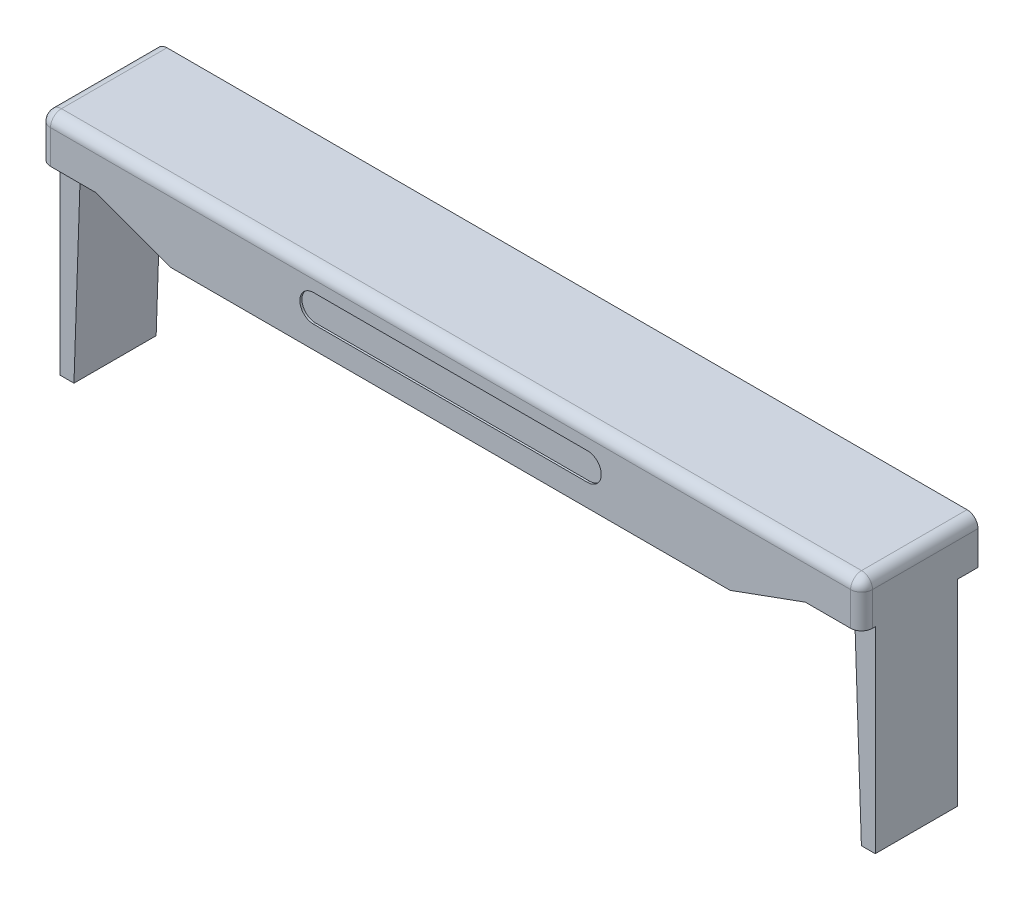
ISO-10303-21;
HEADER;
FILE_DESCRIPTION(('STEP AP214'),'2;1');
FILE_NAME('part.step','',(''),(''),'','','');
FILE_SCHEMA(('AUTOMOTIVE_DESIGN { 1 0 10303 214 1 1 1 1 }'));
ENDSEC;
DATA;
#1=APPLICATION_CONTEXT('core data for automotive mechanical design processes');
#2=APPLICATION_PROTOCOL_DEFINITION('international standard','automotive_design',2000,#1);
#3=PRODUCT_CONTEXT('',#1,'mechanical');
#4=PRODUCT('Part','Part','',(#3));
#5=PRODUCT_RELATED_PRODUCT_CATEGORY('part','',(#4));
#6=PRODUCT_DEFINITION_FORMATION('','',#4);
#7=PRODUCT_DEFINITION_CONTEXT('part definition',#1,'design');
#8=PRODUCT_DEFINITION('design','',#6,#7);
#9=PRODUCT_DEFINITION_SHAPE('','',#8);
#10=(LENGTH_UNIT() NAMED_UNIT(*) SI_UNIT(.MILLI.,.METRE.));
#11=(NAMED_UNIT(*) PLANE_ANGLE_UNIT() SI_UNIT($,.RADIAN.));
#12=(NAMED_UNIT(*) SI_UNIT($,.STERADIAN.) SOLID_ANGLE_UNIT());
#13=UNCERTAINTY_MEASURE_WITH_UNIT(LENGTH_MEASURE(1.E-05),#10,'distance_accuracy_value','');
#14=(GEOMETRIC_REPRESENTATION_CONTEXT(3) GLOBAL_UNCERTAINTY_ASSIGNED_CONTEXT((#13)) GLOBAL_UNIT_ASSIGNED_CONTEXT((#10,
#11,#12)) REPRESENTATION_CONTEXT('',''));
#15=CARTESIAN_POINT('',(0.,0.,0.));
#16=DIRECTION('',(0.,0.,1.));
#17=DIRECTION('',(1.,0.,0.));
#18=AXIS2_PLACEMENT_3D('',#15,#16,#17);
#19=CARTESIAN_POINT('',(0.,-4.00003287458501,-5.5));
#20=DIRECTION('',(0.,0.,-1.));
#21=DIRECTION('',(0.,1.,0.));
#22=AXIS2_PLACEMENT_3D('',#19,#20,#21);
#23=PLANE('',#22);
#24=DIRECTION('',(-1.,0.,0.));
#25=VECTOR('',#24,1.);
#26=CARTESIAN_POINT('',(57.9770212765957,-28.6999999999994,-5.5));
#27=LINE('',#26,#25);
#28=CARTESIAN_POINT('',(60.,-28.6999999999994,-5.5));
#29=VERTEX_POINT('',#28);
#30=CARTESIAN_POINT('',(57.9770212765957,-28.6999999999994,-5.5));
#31=VERTEX_POINT('',#30);
#32=EDGE_CURVE('E353',#29,#31,#27,.T.);
#33=ORIENTED_EDGE('',*,*,#32,.T.);
#34=DIRECTION('',(-0.0340228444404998,0.999421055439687,0.));
#35=VECTOR('',#34,1.);
#36=CARTESIAN_POINT('',(57.9770212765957,-28.6999999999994,-5.5));
#37=LINE('',#36,#35);
#38=CARTESIAN_POINT('',(57.,5.6399329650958E-13,-5.5));
#39=VERTEX_POINT('',#38);
#40=EDGE_CURVE('E384',#31,#39,#37,.T.);
#41=ORIENTED_EDGE('',*,*,#40,.T.);
#42=DIRECTION('',(1.,0.,0.));
#43=VECTOR('',#42,1.);
#44=CARTESIAN_POINT('',(60.,5.62216939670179E-13,-5.5));
#45=LINE('',#44,#43);
#46=CARTESIAN_POINT('',(60.,5.62216939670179E-13,-5.5));
#47=VERTEX_POINT('',#46);
#48=EDGE_CURVE('E290',#39,#47,#45,.T.);
#49=ORIENTED_EDGE('',*,*,#48,.T.);
#50=DIRECTION('',(0.,-1.,0.));
#51=VECTOR('',#50,1.);
#52=CARTESIAN_POINT('',(60.,5.62216939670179E-13,-5.5));
#53=LINE('',#52,#51);
#54=EDGE_CURVE('E305',#47,#29,#53,.T.);
#55=ORIENTED_EDGE('',*,*,#54,.T.);
#56=EDGE_LOOP('',(#33,#41,#49,#55));
#57=FACE_BOUND('',#56,.T.);
#58=ADVANCED_FACE('F16',(#57),#23,.T.);
#59=CARTESIAN_POINT('',(0.,-4.00003287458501,5.5));
#60=DIRECTION('',(0.,0.,1.));
#61=DIRECTION('',(1.,0.,0.));
#62=AXIS2_PLACEMENT_3D('',#59,#60,#61);
#63=PLANE('',#62);
#64=DIRECTION('',(1.,0.,0.));
#65=VECTOR('',#64,1.);
#66=CARTESIAN_POINT('',(-57.9770212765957,-28.6999999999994,5.5));
#67=LINE('',#66,#65);
#68=CARTESIAN_POINT('',(-60.,-28.6999999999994,5.5));
#69=VERTEX_POINT('',#68);
#70=CARTESIAN_POINT('',(-57.9770212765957,-28.6999999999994,5.5));
#71=VERTEX_POINT('',#70);
#72=EDGE_CURVE('E403',#69,#71,#67,.T.);
#73=ORIENTED_EDGE('',*,*,#72,.T.);
#74=DIRECTION('',(0.0340228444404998,0.999421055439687,0.));
#75=VECTOR('',#74,1.);
#76=CARTESIAN_POINT('',(-57.9770212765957,-28.6999999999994,5.5));
#77=LINE('',#76,#75);
#78=CARTESIAN_POINT('',(-57.,5.6754601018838E-13,5.5));
#79=VERTEX_POINT('',#78);
#80=EDGE_CURVE('E358',#71,#79,#77,.T.);
#81=ORIENTED_EDGE('',*,*,#80,.T.);
#82=DIRECTION('',(-1.,0.,0.));
#83=VECTOR('',#82,1.);
#84=CARTESIAN_POINT('',(-60.,5.6399329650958E-13,5.5));
#85=LINE('',#84,#83);
#86=CARTESIAN_POINT('',(-60.,5.6399329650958E-13,5.5));
#87=VERTEX_POINT('',#86);
#88=EDGE_CURVE('E298',#79,#87,#85,.T.);
#89=ORIENTED_EDGE('',*,*,#88,.T.);
#90=DIRECTION('',(0.,-1.,0.));
#91=VECTOR('',#90,1.);
#92=CARTESIAN_POINT('',(-60.,5.6399329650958E-13,5.5));
#93=LINE('',#92,#91);
#94=EDGE_CURVE('E491',#87,#69,#93,.T.);
#95=ORIENTED_EDGE('',*,*,#94,.T.);
#96=EDGE_LOOP('',(#73,#81,#89,#95));
#97=FACE_BOUND('',#96,.T.);
#98=ADVANCED_FACE('F587',(#97),#63,.T.);
#99=CARTESIAN_POINT('',(20.,1.24996712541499,8.2));
#100=DIRECTION('',(0.,0.,-1.));
#101=DIRECTION('',(0.,1.,0.));
#102=AXIS2_PLACEMENT_3D('',#99,#100,#101);
#103=PLANE('',#102);
#104=CARTESIAN_POINT('',(20.,1.24996712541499,8.2));
#105=DIRECTION('',(0.,0.,-1.));
#106=DIRECTION('',(0.,1.,0.));
#107=AXIS2_PLACEMENT_3D('',#104,#105,#106);
#108=CIRCLE('',#107,2.);
#109=CARTESIAN_POINT('',(20.,3.24996712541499,8.2));
#110=VERTEX_POINT('',#109);
#111=CARTESIAN_POINT('',(20.,-0.75003287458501,8.2));
#112=VERTEX_POINT('',#111);
#113=EDGE_CURVE('E454',#110,#112,#108,.T.);
#114=ORIENTED_EDGE('',*,*,#113,.F.);
#115=DIRECTION('',(1.,0.,0.));
#116=VECTOR('',#115,1.);
#117=CARTESIAN_POINT('',(20.,3.24996712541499,8.2));
#118=LINE('',#117,#116);
#119=CARTESIAN_POINT('',(-20.,3.24996712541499,8.2));
#120=VERTEX_POINT('',#119);
#121=EDGE_CURVE('E11',#120,#110,#118,.T.);
#122=ORIENTED_EDGE('',*,*,#121,.F.);
#123=CARTESIAN_POINT('',(-20.,1.24996712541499,8.2));
#124=DIRECTION('',(0.,0.,-1.));
#125=DIRECTION('',(0.,1.,0.));
#126=AXIS2_PLACEMENT_3D('',#123,#124,#125);
#127=CIRCLE('',#126,2.);
#128=CARTESIAN_POINT('',(-20.,-0.750032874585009,8.2));
#129=VERTEX_POINT('',#128);
#130=EDGE_CURVE('E40',#129,#120,#127,.T.);
#131=ORIENTED_EDGE('',*,*,#130,.F.);
#132=DIRECTION('',(-1.,0.,0.));
#133=VECTOR('',#132,1.);
#134=CARTESIAN_POINT('',(20.,-0.75003287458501,8.2));
#135=LINE('',#134,#133);
#136=EDGE_CURVE('E333',#112,#129,#135,.T.);
#137=ORIENTED_EDGE('',*,*,#136,.F.);
#138=EDGE_LOOP('',(#114,#122,#131,#137));
#139=FACE_BOUND('',#138,.T.);
#140=ADVANCED_FACE('F591',(#139),#103,.F.);
#141=CARTESIAN_POINT('',(20.,3.24996712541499,8.2));
#142=DIRECTION('',(0.,-1.,0.));
#143=DIRECTION('',(1.,0.,0.));
#144=AXIS2_PLACEMENT_3D('',#141,#142,#143);
#145=PLANE('',#144);
#146=DIRECTION('',(1.,0.,0.));
#147=VECTOR('',#146,1.);
#148=CARTESIAN_POINT('',(20.,3.24996712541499,8.5));
#149=LINE('',#148,#147);
#150=CARTESIAN_POINT('',(-20.,3.24996712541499,8.5));
#151=VERTEX_POINT('',#150);
#152=CARTESIAN_POINT('',(20.,3.24996712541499,8.5));
#153=VERTEX_POINT('',#152);
#154=EDGE_CURVE('E487',#151,#153,#149,.T.);
#155=ORIENTED_EDGE('',*,*,#154,.F.);
#156=DIRECTION('',(0.,0.,1.));
#157=VECTOR('',#156,1.);
#158=CARTESIAN_POINT('',(-20.,3.24996712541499,8.2));
#159=LINE('',#158,#157);
#160=EDGE_CURVE('E24',#120,#151,#159,.T.);
#161=ORIENTED_EDGE('',*,*,#160,.F.);
#162=ORIENTED_EDGE('',*,*,#121,.T.);
#163=DIRECTION('',(0.,0.,1.));
#164=VECTOR('',#163,1.);
#165=CARTESIAN_POINT('',(20.,3.24996712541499,8.2));
#166=LINE('',#165,#164);
#167=EDGE_CURVE('E332',#110,#153,#166,.T.);
#168=ORIENTED_EDGE('',*,*,#167,.T.);
#169=EDGE_LOOP('',(#155,#161,#162,#168));
#170=FACE_BOUND('',#169,.T.);
#171=ADVANCED_FACE('F596',(#170),#145,.T.);
#172=CARTESIAN_POINT('',(-20.,1.24996712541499,8.2));
#173=DIRECTION('',(0.,0.,1.));
#174=DIRECTION('',(0.,-1.,0.));
#175=AXIS2_PLACEMENT_3D('',#172,#173,#174);
#176=CYLINDRICAL_SURFACE('',#175,2.);
#177=CARTESIAN_POINT('',(-20.,1.24996712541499,8.5));
#178=DIRECTION('',(0.,0.,-1.));
#179=DIRECTION('',(0.,1.,0.));
#180=AXIS2_PLACEMENT_3D('',#177,#178,#179);
#181=CIRCLE('',#180,2.);
#182=CARTESIAN_POINT('',(-20.,-0.750032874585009,8.5));
#183=VERTEX_POINT('',#182);
#184=EDGE_CURVE('E483',#183,#151,#181,.T.);
#185=ORIENTED_EDGE('',*,*,#184,.F.);
#186=DIRECTION('',(0.,0.,1.));
#187=VECTOR('',#186,1.);
#188=CARTESIAN_POINT('',(-20.,-0.750032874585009,8.2));
#189=LINE('',#188,#187);
#190=EDGE_CURVE('E336',#129,#183,#189,.T.);
#191=ORIENTED_EDGE('',*,*,#190,.F.);
#192=ORIENTED_EDGE('',*,*,#130,.T.);
#193=ORIENTED_EDGE('',*,*,#160,.T.);
#194=EDGE_LOOP('',(#185,#191,#192,#193));
#195=FACE_BOUND('',#194,.T.);
#196=ADVANCED_FACE('F601',(#195),#176,.F.);
#197=CARTESIAN_POINT('',(20.,-0.75003287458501,8.2));
#198=DIRECTION('',(0.,1.,0.));
#199=DIRECTION('',(-1.,0.,0.));
#200=AXIS2_PLACEMENT_3D('',#197,#198,#199);
#201=PLANE('',#200);
#202=DIRECTION('',(-1.,0.,0.));
#203=VECTOR('',#202,1.);
#204=CARTESIAN_POINT('',(20.,-0.75003287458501,8.5));
#205=LINE('',#204,#203);
#206=CARTESIAN_POINT('',(20.,-0.75003287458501,8.5));
#207=VERTEX_POINT('',#206);
#208=EDGE_CURVE('E477',#207,#183,#205,.T.);
#209=ORIENTED_EDGE('',*,*,#208,.F.);
#210=DIRECTION('',(0.,0.,1.));
#211=VECTOR('',#210,1.);
#212=CARTESIAN_POINT('',(20.,-0.75003287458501,8.2));
#213=LINE('',#212,#211);
#214=EDGE_CURVE('E337',#112,#207,#213,.T.);
#215=ORIENTED_EDGE('',*,*,#214,.F.);
#216=ORIENTED_EDGE('',*,*,#136,.T.);
#217=ORIENTED_EDGE('',*,*,#190,.T.);
#218=EDGE_LOOP('',(#209,#215,#216,#217));
#219=FACE_BOUND('',#218,.T.);
#220=ADVANCED_FACE('F605',(#219),#201,.T.);
#221=CARTESIAN_POINT('',(20.,1.24996712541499,8.2));
#222=DIRECTION('',(0.,0.,1.));
#223=DIRECTION('',(0.,-1.,0.));
#224=AXIS2_PLACEMENT_3D('',#221,#222,#223);
#225=CYLINDRICAL_SURFACE('',#224,2.);
#226=CARTESIAN_POINT('',(20.,1.24996712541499,8.5));
#227=DIRECTION('',(0.,0.,-1.));
#228=DIRECTION('',(0.,1.,0.));
#229=AXIS2_PLACEMENT_3D('',#226,#227,#228);
#230=CIRCLE('',#229,2.);
#231=EDGE_CURVE('E473',#153,#207,#230,.T.);
#232=ORIENTED_EDGE('',*,*,#231,.F.);
#233=ORIENTED_EDGE('',*,*,#167,.F.);
#234=ORIENTED_EDGE('',*,*,#113,.T.);
#235=ORIENTED_EDGE('',*,*,#214,.T.);
#236=EDGE_LOOP('',(#232,#233,#234,#235));
#237=FACE_BOUND('',#236,.T.);
#238=ADVANCED_FACE('F608',(#237),#225,.F.);
#239=CARTESIAN_POINT('',(58.4,4.89996712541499,-8.5));
#240=DIRECTION('',(0.,0.,1.));
#241=DIRECTION('',(0.,-1.,0.));
#242=AXIS2_PLACEMENT_3D('',#239,#240,#241);
#243=CYLINDRICAL_SURFACE('',#242,1.6);
#244=CARTESIAN_POINT('',(58.4,4.89996712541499,-8.5));
#245=DIRECTION('',(0.,0.,-1.));
#246=DIRECTION('',(0.,1.,0.));
#247=AXIS2_PLACEMENT_3D('',#244,#245,#246);
#248=CIRCLE('',#247,1.6);
#249=CARTESIAN_POINT('',(58.4,6.49996712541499,-8.5));
#250=VERTEX_POINT('',#249);
#251=CARTESIAN_POINT('',(60.,4.89996712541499,-8.5));
#252=VERTEX_POINT('',#251);
#253=EDGE_CURVE('E232',#250,#252,#248,.T.);
#254=ORIENTED_EDGE('',*,*,#253,.F.);
#255=DIRECTION('',(0.,0.,-1.));
#256=VECTOR('',#255,1.);
#257=CARTESIAN_POINT('',(58.4,6.49996712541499,-8.5));
#258=LINE('',#257,#256);
#259=CARTESIAN_POINT('',(58.4,6.49996712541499,6.9));
#260=VERTEX_POINT('',#259);
#261=EDGE_CURVE('E286',#260,#250,#258,.T.);
#262=ORIENTED_EDGE('',*,*,#261,.F.);
#263=CARTESIAN_POINT('',(58.4,4.89996712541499,6.9));
#264=DIRECTION('',(0.,0.,-1.));
#265=DIRECTION('',(0.,-1.,0.));
#266=AXIS2_PLACEMENT_3D('',#263,#264,#265);
#267=CIRCLE('',#266,1.6);
#268=CARTESIAN_POINT('',(60.,4.89996712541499,6.9));
#269=VERTEX_POINT('',#268);
#270=EDGE_CURVE('E234',#260,#269,#267,.T.);
#271=ORIENTED_EDGE('',*,*,#270,.T.);
#272=DIRECTION('',(0.,0.,1.));
#273=VECTOR('',#272,1.);
#274=CARTESIAN_POINT('',(60.,4.89996712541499,-8.5));
#275=LINE('',#274,#273);
#276=EDGE_CURVE('E227',#252,#269,#275,.T.);
#277=ORIENTED_EDGE('',*,*,#276,.F.);
#278=EDGE_LOOP('',(#254,#262,#271,#277));
#279=FACE_BOUND('',#278,.T.);
#280=ADVANCED_FACE('F229',(#279),#243,.T.);
#281=CARTESIAN_POINT('',(58.4,4.89996712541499,6.9));
#282=DIRECTION('',(0.,0.,1.));
#283=DIRECTION('',(1.,0.,0.));
#284=AXIS2_PLACEMENT_3D('',#281,#282,#283);
#285=SPHERICAL_SURFACE('',#284,1.6);
#286=CARTESIAN_POINT('',(58.4,4.89996712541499,6.9));
#287=DIRECTION('',(1.,0.,0.));
#288=DIRECTION('',(0.,1.,0.));
#289=AXIS2_PLACEMENT_3D('',#286,#287,#288);
#290=CIRCLE('',#289,1.6);
#291=CARTESIAN_POINT('',(58.4,4.89996712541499,8.5));
#292=VERTEX_POINT('',#291);
#293=EDGE_CURVE('E327',#260,#292,#290,.T.);
#294=ORIENTED_EDGE('',*,*,#293,.T.);
#295=CARTESIAN_POINT('',(58.4,4.89996712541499,6.9));
#296=DIRECTION('',(0.,1.,0.));
#297=DIRECTION('',(-1.,0.,0.));
#298=AXIS2_PLACEMENT_3D('',#295,#296,#297);
#299=CIRCLE('',#298,1.6);
#300=EDGE_CURVE('E326',#292,#269,#299,.T.);
#301=ORIENTED_EDGE('',*,*,#300,.T.);
#302=ORIENTED_EDGE('',*,*,#270,.F.);
#303=EDGE_LOOP('',(#294,#301,#302));
#304=FACE_BOUND('',#303,.T.);
#305=ADVANCED_FACE('F551',(#304),#285,.T.);
#306=CARTESIAN_POINT('',(-60.,4.89996712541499,6.9));
#307=DIRECTION('',(1.,0.,0.));
#308=DIRECTION('',(0.,1.,0.));
#309=AXIS2_PLACEMENT_3D('',#306,#307,#308);
#310=CYLINDRICAL_SURFACE('',#309,1.6);
#311=CARTESIAN_POINT('',(-58.4,4.89996712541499,6.9));
#312=DIRECTION('',(1.,0.,0.));
#313=DIRECTION('',(0.,-1.,0.));
#314=AXIS2_PLACEMENT_3D('',#311,#312,#313);
#315=CIRCLE('',#314,1.6);
#316=CARTESIAN_POINT('',(-58.4,6.49996712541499,6.9));
#317=VERTEX_POINT('',#316);
#318=CARTESIAN_POINT('',(-58.4,4.89996712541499,8.5));
#319=VERTEX_POINT('',#318);
#320=EDGE_CURVE('E323',#317,#319,#315,.T.);
#321=ORIENTED_EDGE('',*,*,#320,.T.);
#322=DIRECTION('',(-1.,0.,0.));
#323=VECTOR('',#322,1.);
#324=CARTESIAN_POINT('',(-60.,4.89996712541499,8.5));
#325=LINE('',#324,#323);
#326=EDGE_CURVE('E439',#292,#319,#325,.T.);
#327=ORIENTED_EDGE('',*,*,#326,.F.);
#328=ORIENTED_EDGE('',*,*,#293,.F.);
#329=DIRECTION('',(1.,0.,0.));
#330=VECTOR('',#329,1.);
#331=CARTESIAN_POINT('',(60.,6.49996712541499,6.9));
#332=LINE('',#331,#330);
#333=EDGE_CURVE('E282',#317,#260,#332,.T.);
#334=ORIENTED_EDGE('',*,*,#333,.F.);
#335=EDGE_LOOP('',(#321,#327,#328,#334));
#336=FACE_BOUND('',#335,.T.);
#337=ADVANCED_FACE('F547',(#336),#310,.T.);
#338=CARTESIAN_POINT('',(58.4,-4.00003287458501,6.9));
#339=DIRECTION('',(0.,1.,0.));
#340=DIRECTION('',(-1.,0.,0.));
#341=AXIS2_PLACEMENT_3D('',#338,#339,#340);
#342=CYLINDRICAL_SURFACE('',#341,1.6);
#343=CARTESIAN_POINT('',(58.4,5.48894263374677E-13,6.9));
#344=DIRECTION('',(0.,-1.,0.));
#345=DIRECTION('',(1.,0.,0.));
#346=AXIS2_PLACEMENT_3D('',#343,#344,#345);
#347=CIRCLE('',#346,1.6);
#348=CARTESIAN_POINT('',(60.,5.6399329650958E-13,6.9));
#349=VERTEX_POINT('',#348);
#350=CARTESIAN_POINT('',(58.4,5.48894263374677E-13,8.5));
#351=VERTEX_POINT('',#350);
#352=EDGE_CURVE('E276',#349,#351,#347,.T.);
#353=ORIENTED_EDGE('',*,*,#352,.F.);
#354=DIRECTION('',(0.,-1.,0.));
#355=VECTOR('',#354,1.);
#356=CARTESIAN_POINT('',(60.,5.6399329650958E-13,6.9));
#357=LINE('',#356,#355);
#358=EDGE_CURVE('E239',#269,#349,#357,.T.);
#359=ORIENTED_EDGE('',*,*,#358,.F.);
#360=ORIENTED_EDGE('',*,*,#300,.F.);
#361=DIRECTION('',(0.,1.,0.));
#362=VECTOR('',#361,1.);
#363=CARTESIAN_POINT('',(58.4,6.49996712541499,8.5));
#364=LINE('',#363,#362);
#365=EDGE_CURVE('E432',#351,#292,#364,.T.);
#366=ORIENTED_EDGE('',*,*,#365,.F.);
#367=EDGE_LOOP('',(#353,#359,#360,#366));
#368=FACE_BOUND('',#367,.T.);
#369=ADVANCED_FACE('F555',(#368),#342,.T.);
#370=CARTESIAN_POINT('',(-58.4,4.89996712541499,6.9));
#371=DIRECTION('',(0.,0.,1.));
#372=DIRECTION('',(1.,0.,0.));
#373=AXIS2_PLACEMENT_3D('',#370,#371,#372);
#374=SPHERICAL_SURFACE('',#373,1.6);
#375=CARTESIAN_POINT('',(-58.4,4.89996712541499,6.9));
#376=DIRECTION('',(0.,0.,1.));
#377=DIRECTION('',(0.,-1.,0.));
#378=AXIS2_PLACEMENT_3D('',#375,#376,#377);
#379=CIRCLE('',#378,1.6);
#380=CARTESIAN_POINT('',(-60.,4.89996712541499,6.9));
#381=VERTEX_POINT('',#380);
#382=EDGE_CURVE('E275',#317,#381,#379,.T.);
#383=ORIENTED_EDGE('',*,*,#382,.T.);
#384=CARTESIAN_POINT('',(-58.4,4.89996712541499,6.9));
#385=DIRECTION('',(0.,1.,0.));
#386=DIRECTION('',(-1.,0.,0.));
#387=AXIS2_PLACEMENT_3D('',#384,#385,#386);
#388=CIRCLE('',#387,1.6);
#389=EDGE_CURVE('E271',#381,#319,#388,.T.);
#390=ORIENTED_EDGE('',*,*,#389,.T.);
#391=ORIENTED_EDGE('',*,*,#320,.F.);
#392=EDGE_LOOP('',(#383,#390,#391));
#393=FACE_BOUND('',#392,.T.);
#394=ADVANCED_FACE('F620',(#393),#374,.T.);
#395=CARTESIAN_POINT('',(-58.4,4.89996712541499,-8.5));
#396=DIRECTION('',(0.,0.,1.));
#397=DIRECTION('',(0.,-1.,0.));
#398=AXIS2_PLACEMENT_3D('',#395,#396,#397);
#399=CYLINDRICAL_SURFACE('',#398,1.6);
#400=CARTESIAN_POINT('',(-58.4,4.89996712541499,-8.5));
#401=DIRECTION('',(0.,0.,-1.));
#402=DIRECTION('',(0.,1.,0.));
#403=AXIS2_PLACEMENT_3D('',#400,#401,#402);
#404=CIRCLE('',#403,1.6);
#405=CARTESIAN_POINT('',(-60.,4.89996712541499,-8.5));
#406=VERTEX_POINT('',#405);
#407=CARTESIAN_POINT('',(-58.4,6.49996712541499,-8.5));
#408=VERTEX_POINT('',#407);
#409=EDGE_CURVE('E279',#406,#408,#404,.T.);
#410=ORIENTED_EDGE('',*,*,#409,.F.);
#411=DIRECTION('',(0.,0.,-1.));
#412=VECTOR('',#411,1.);
#413=CARTESIAN_POINT('',(-60.,4.89996712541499,-8.5));
#414=LINE('',#413,#412);
#415=EDGE_CURVE('E504',#381,#406,#414,.T.);
#416=ORIENTED_EDGE('',*,*,#415,.F.);
#417=ORIENTED_EDGE('',*,*,#382,.F.);
#418=DIRECTION('',(0.,0.,1.));
#419=VECTOR('',#418,1.);
#420=CARTESIAN_POINT('',(-58.4,6.49996712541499,-8.5));
#421=LINE('',#420,#419);
#422=EDGE_CURVE('E289',#408,#317,#421,.T.);
#423=ORIENTED_EDGE('',*,*,#422,.F.);
#424=EDGE_LOOP('',(#410,#416,#417,#423));
#425=FACE_BOUND('',#424,.T.);
#426=ADVANCED_FACE('F541',(#425),#399,.T.);
#427=CARTESIAN_POINT('',(-58.4,6.49996712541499,6.9));
#428=DIRECTION('',(0.,1.,0.));
#429=DIRECTION('',(-1.,0.,0.));
#430=AXIS2_PLACEMENT_3D('',#427,#428,#429);
#431=CYLINDRICAL_SURFACE('',#430,1.6);
#432=CARTESIAN_POINT('',(-58.4,5.48894263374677E-13,6.9));
#433=DIRECTION('',(0.,-1.,0.));
#434=DIRECTION('',(1.,0.,0.));
#435=AXIS2_PLACEMENT_3D('',#432,#433,#434);
#436=CIRCLE('',#435,1.6);
#437=CARTESIAN_POINT('',(-58.4,5.48894263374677E-13,8.5));
#438=VERTEX_POINT('',#437);
#439=CARTESIAN_POINT('',(-60.,5.6399329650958E-13,6.9));
#440=VERTEX_POINT('',#439);
#441=EDGE_CURVE('E304',#438,#440,#436,.T.);
#442=ORIENTED_EDGE('',*,*,#441,.F.);
#443=DIRECTION('',(0.,-1.,0.));
#444=VECTOR('',#443,1.);
#445=CARTESIAN_POINT('',(-58.4,5.6399329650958E-13,8.5));
#446=LINE('',#445,#444);
#447=EDGE_CURVE('E443',#319,#438,#446,.T.);
#448=ORIENTED_EDGE('',*,*,#447,.F.);
#449=ORIENTED_EDGE('',*,*,#389,.F.);
#450=DIRECTION('',(0.,1.,0.));
#451=VECTOR('',#450,1.);
#452=CARTESIAN_POINT('',(-60.,6.49996712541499,6.9));
#453=LINE('',#452,#451);
#454=EDGE_CURVE('E500',#440,#381,#453,.T.);
#455=ORIENTED_EDGE('',*,*,#454,.F.);
#456=EDGE_LOOP('',(#442,#448,#449,#455));
#457=FACE_BOUND('',#456,.T.);
#458=ADVANCED_FACE('F623',(#457),#431,.T.);
#459=CARTESIAN_POINT('',(0.,-4.00003287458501,6.5));
#460=DIRECTION('',(0.,0.,1.));
#461=DIRECTION('',(1.,0.,0.));
#462=AXIS2_PLACEMENT_3D('',#459,#460,#461);
#463=PLANE('',#462);
#464=DIRECTION('',(-1.,0.,0.));
#465=VECTOR('',#464,1.);
#466=CARTESIAN_POINT('',(57.9770212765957,-28.6999999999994,6.5));
#467=LINE('',#466,#465);
#468=CARTESIAN_POINT('',(60.,-28.6999999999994,6.5));
#469=VERTEX_POINT('',#468);
#470=CARTESIAN_POINT('',(57.9770212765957,-28.6999999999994,6.5));
#471=VERTEX_POINT('',#470);
#472=EDGE_CURVE('E369',#469,#471,#467,.T.);
#473=ORIENTED_EDGE('',*,*,#472,.F.);
#474=DIRECTION('',(0.,-1.,0.));
#475=VECTOR('',#474,1.);
#476=CARTESIAN_POINT('',(60.,5.6399329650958E-13,6.5));
#477=LINE('',#476,#475);
#478=CARTESIAN_POINT('',(60.,5.6399329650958E-13,6.5));
#479=VERTEX_POINT('',#478);
#480=EDGE_CURVE('E316',#479,#469,#477,.T.);
#481=ORIENTED_EDGE('',*,*,#480,.F.);
#482=DIRECTION('',(1.,0.,0.));
#483=VECTOR('',#482,1.);
#484=CARTESIAN_POINT('',(60.,5.6399329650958E-13,6.5));
#485=LINE('',#484,#483);
#486=CARTESIAN_POINT('',(57.,5.6399329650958E-13,6.5));
#487=VERTEX_POINT('',#486);
#488=EDGE_CURVE('E293',#487,#479,#485,.T.);
#489=ORIENTED_EDGE('',*,*,#488,.F.);
#490=DIRECTION('',(-0.0340228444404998,0.999421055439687,0.));
#491=VECTOR('',#490,1.);
#492=CARTESIAN_POINT('',(57.9770212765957,-28.6999999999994,6.5));
#493=LINE('',#492,#491);
#494=EDGE_CURVE('E392',#471,#487,#493,.T.);
#495=ORIENTED_EDGE('',*,*,#494,.F.);
#496=EDGE_LOOP('',(#473,#481,#489,#495));
#497=FACE_BOUND('',#496,.T.);
#498=ADVANCED_FACE('F563',(#497),#463,.T.);
#499=CARTESIAN_POINT('',(51.79,4.86721773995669E-13,8.5));
#500=DIRECTION('',(0.,-1.,0.));
#501=DIRECTION('',(1.,0.,0.));
#502=AXIS2_PLACEMENT_3D('',#499,#500,#501);
#503=PLANE('',#502);
#504=ORIENTED_EDGE('',*,*,#48,.F.);
#505=DIRECTION('',(0.,0.,-1.));
#506=VECTOR('',#505,1.);
#507=CARTESIAN_POINT('',(57.,5.6399329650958E-13,6.5));
#508=LINE('',#507,#506);
#509=EDGE_CURVE('E399',#487,#39,#508,.T.);
#510=ORIENTED_EDGE('',*,*,#509,.F.);
#511=ORIENTED_EDGE('',*,*,#488,.T.);
#512=DIRECTION('',(0.,0.,-1.));
#513=VECTOR('',#512,1.);
#514=CARTESIAN_POINT('',(60.,5.6399329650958E-13,8.5));
#515=LINE('',#514,#513);
#516=EDGE_CURVE('E312',#349,#479,#515,.T.);
#517=ORIENTED_EDGE('',*,*,#516,.F.);
#518=ORIENTED_EDGE('',*,*,#352,.T.);
#519=DIRECTION('',(1.,0.,0.));
#520=VECTOR('',#519,1.);
#521=CARTESIAN_POINT('',(51.79,4.86721773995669E-13,8.5));
#522=LINE('',#521,#520);
#523=CARTESIAN_POINT('',(51.79,4.86721773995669E-13,8.5));
#524=VERTEX_POINT('',#523);
#525=EDGE_CURVE('E372',#524,#351,#522,.T.);
#526=ORIENTED_EDGE('',*,*,#525,.F.);
#527=DIRECTION('',(0.,0.,-1.));
#528=VECTOR('',#527,1.);
#529=CARTESIAN_POINT('',(51.79,4.86721773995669E-13,8.5));
#530=LINE('',#529,#528);
#531=CARTESIAN_POINT('',(51.79,4.86721773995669E-13,-8.5));
#532=VERTEX_POINT('',#531);
#533=EDGE_CURVE('E294',#524,#532,#530,.T.);
#534=ORIENTED_EDGE('',*,*,#533,.T.);
#535=DIRECTION('',(1.,0.,0.));
#536=VECTOR('',#535,1.);
#537=CARTESIAN_POINT('',(60.,5.6399329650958E-13,-8.5));
#538=LINE('',#537,#536);
#539=CARTESIAN_POINT('',(60.,5.24025267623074E-13,-8.5));
#540=VERTEX_POINT('',#539);
#541=EDGE_CURVE('E251',#532,#540,#538,.T.);
#542=ORIENTED_EDGE('',*,*,#541,.T.);
#543=DIRECTION('',(0.,0.,-1.));
#544=VECTOR('',#543,1.);
#545=CARTESIAN_POINT('',(60.,5.6399329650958E-13,8.5));
#546=LINE('',#545,#544);
#547=EDGE_CURVE('E240',#47,#540,#546,.T.);
#548=ORIENTED_EDGE('',*,*,#547,.F.);
#549=EDGE_LOOP('',(#504,#510,#511,#517,#518,#526,#534,#542,#548));
#550=FACE_BOUND('',#549,.T.);
#551=ADVANCED_FACE('F560',(#550),#503,.T.);
#552=CARTESIAN_POINT('',(40.8,-4.00003287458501,8.5));
#553=DIRECTION('',(0.342020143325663,-0.939692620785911,0.));
#554=DIRECTION('',(0.,0.,-1.));
#555=AXIS2_PLACEMENT_3D('',#552,#553,#554);
#556=PLANE('',#555);
#557=DIRECTION('',(0.939692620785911,0.342020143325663,0.));
#558=VECTOR('',#557,1.);
#559=CARTESIAN_POINT('',(61.1286616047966,3.398994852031,-8.5));
#560=LINE('',#559,#558);
#561=CARTESIAN_POINT('',(40.8,-4.00003287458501,-8.5));
#562=VERTEX_POINT('',#561);
#563=EDGE_CURVE('E270',#562,#532,#560,.T.);
#564=ORIENTED_EDGE('',*,*,#563,.T.);
#565=ORIENTED_EDGE('',*,*,#533,.F.);
#566=DIRECTION('',(0.939692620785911,0.342020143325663,0.));
#567=VECTOR('',#566,1.);
#568=CARTESIAN_POINT('',(40.8,-4.00003287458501,8.5));
#569=LINE('',#568,#567);
#570=CARTESIAN_POINT('',(40.8,-4.00003287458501,8.5));
#571=VERTEX_POINT('',#570);
#572=EDGE_CURVE('E467',#571,#524,#569,.T.);
#573=ORIENTED_EDGE('',*,*,#572,.F.);
#574=DIRECTION('',(0.,0.,-1.));
#575=VECTOR('',#574,1.);
#576=CARTESIAN_POINT('',(40.8,-4.00003287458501,8.5));
#577=LINE('',#576,#575);
#578=EDGE_CURVE('E262',#571,#562,#577,.T.);
#579=ORIENTED_EDGE('',*,*,#578,.T.);
#580=EDGE_LOOP('',(#564,#565,#573,#579));
#581=FACE_BOUND('',#580,.T.);
#582=ADVANCED_FACE('F524',(#581),#556,.T.);
#583=CARTESIAN_POINT('',(60.,-4.00003287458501,-8.5));
#584=DIRECTION('',(1.,0.,0.));
#585=DIRECTION('',(0.,-1.,0.));
#586=AXIS2_PLACEMENT_3D('',#583,#584,#585);
#587=PLANE('',#586);
#588=ORIENTED_EDGE('',*,*,#54,.F.);
#589=ORIENTED_EDGE('',*,*,#547,.T.);
#590=DIRECTION('',(0.,-1.,0.));
#591=VECTOR('',#590,1.);
#592=CARTESIAN_POINT('',(60.,-4.00003287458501,-8.5));
#593=LINE('',#592,#591);
#594=EDGE_CURVE('E243',#252,#540,#593,.T.);
#595=ORIENTED_EDGE('',*,*,#594,.F.);
#596=ORIENTED_EDGE('',*,*,#276,.T.);
#597=ORIENTED_EDGE('',*,*,#358,.T.);
#598=ORIENTED_EDGE('',*,*,#516,.T.);
#599=ORIENTED_EDGE('',*,*,#480,.T.);
#600=DIRECTION('',(0.,0.,-1.));
#601=VECTOR('',#600,1.);
#602=CARTESIAN_POINT('',(60.,-28.6999999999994,6.5));
#603=LINE('',#602,#601);
#604=EDGE_CURVE('E365',#469,#29,#603,.T.);
#605=ORIENTED_EDGE('',*,*,#604,.T.);
#606=EDGE_LOOP('',(#588,#589,#595,#596,#597,#598,#599,#605));
#607=FACE_BOUND('',#606,.T.);
#608=ADVANCED_FACE('F245',(#607),#587,.T.);
#609=CARTESIAN_POINT('',(0.,-4.00003287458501,-6.5));
#610=DIRECTION('',(0.,0.,1.));
#611=DIRECTION('',(1.,0.,0.));
#612=AXIS2_PLACEMENT_3D('',#609,#610,#611);
#613=PLANE('',#612);
#614=DIRECTION('',(1.,0.,0.));
#615=VECTOR('',#614,1.);
#616=CARTESIAN_POINT('',(-57.9770212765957,-28.6999999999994,-6.5));
#617=LINE('',#616,#615);
#618=CARTESIAN_POINT('',(-60.,-28.6999999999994,-6.5));
#619=VERTEX_POINT('',#618);
#620=CARTESIAN_POINT('',(-57.9770212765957,-28.6999999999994,-6.5));
#621=VERTEX_POINT('',#620);
#622=EDGE_CURVE('E411',#619,#621,#617,.T.);
#623=ORIENTED_EDGE('',*,*,#622,.F.);
#624=DIRECTION('',(0.,-1.,0.));
#625=VECTOR('',#624,1.);
#626=CARTESIAN_POINT('',(-60.,5.6399329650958E-13,-6.5));
#627=LINE('',#626,#625);
#628=CARTESIAN_POINT('',(-60.,5.6399329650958E-13,-6.5));
#629=VERTEX_POINT('',#628);
#630=EDGE_CURVE('E363',#629,#619,#627,.T.);
#631=ORIENTED_EDGE('',*,*,#630,.F.);
#632=DIRECTION('',(-1.,0.,0.));
#633=VECTOR('',#632,1.);
#634=CARTESIAN_POINT('',(-60.,5.6399329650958E-13,-6.5));
#635=LINE('',#634,#633);
#636=CARTESIAN_POINT('',(-57.,5.6399329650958E-13,-6.5));
#637=VERTEX_POINT('',#636);
#638=EDGE_CURVE('E301',#637,#629,#635,.T.);
#639=ORIENTED_EDGE('',*,*,#638,.F.);
#640=DIRECTION('',(0.0340228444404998,0.999421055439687,0.));
#641=VECTOR('',#640,1.);
#642=CARTESIAN_POINT('',(-57.9770212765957,-28.6999999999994,-6.5));
#643=LINE('',#642,#641);
#644=EDGE_CURVE('E354',#621,#637,#643,.T.);
#645=ORIENTED_EDGE('',*,*,#644,.F.);
#646=EDGE_LOOP('',(#623,#631,#639,#645));
#647=FACE_BOUND('',#646,.T.);
#648=ADVANCED_FACE('F635',(#647),#613,.F.);
#649=CARTESIAN_POINT('',(-51.79,4.86721773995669E-13,8.5));
#650=DIRECTION('',(0.,-1.,0.));
#651=DIRECTION('',(1.,0.,0.));
#652=AXIS2_PLACEMENT_3D('',#649,#650,#651);
#653=PLANE('',#652);
#654=ORIENTED_EDGE('',*,*,#88,.F.);
#655=DIRECTION('',(0.,0.,-1.));
#656=VECTOR('',#655,1.);
#657=CARTESIAN_POINT('',(-57.,5.6399329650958E-13,6.5));
#658=LINE('',#657,#656);
#659=EDGE_CURVE('E357',#79,#637,#658,.T.);
#660=ORIENTED_EDGE('',*,*,#659,.T.);
#661=ORIENTED_EDGE('',*,*,#638,.T.);
#662=DIRECTION('',(0.,0.,-1.));
#663=VECTOR('',#662,1.);
#664=CARTESIAN_POINT('',(-60.,5.6399329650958E-13,8.5));
#665=LINE('',#664,#663);
#666=CARTESIAN_POINT('',(-60.,5.24025267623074E-13,-8.5));
#667=VERTEX_POINT('',#666);
#668=EDGE_CURVE('E359',#629,#667,#665,.T.);
#669=ORIENTED_EDGE('',*,*,#668,.T.);
#670=DIRECTION('',(-1.,0.,0.));
#671=VECTOR('',#670,1.);
#672=CARTESIAN_POINT('',(-60.,5.6399329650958E-13,-8.5));
#673=LINE('',#672,#671);
#674=CARTESIAN_POINT('',(-51.79,4.86721773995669E-13,-8.5));
#675=VERTEX_POINT('',#674);
#676=EDGE_CURVE('E269',#675,#667,#673,.T.);
#677=ORIENTED_EDGE('',*,*,#676,.F.);
#678=DIRECTION('',(0.,0.,-1.));
#679=VECTOR('',#678,1.);
#680=CARTESIAN_POINT('',(-51.79,4.86721773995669E-13,8.5));
#681=LINE('',#680,#679);
#682=CARTESIAN_POINT('',(-51.79,4.86721773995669E-13,8.5));
#683=VERTEX_POINT('',#682);
#684=EDGE_CURVE('E295',#683,#675,#681,.T.);
#685=ORIENTED_EDGE('',*,*,#684,.F.);
#686=DIRECTION('',(-1.,0.,0.));
#687=VECTOR('',#686,1.);
#688=CARTESIAN_POINT('',(-51.79,4.86721773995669E-13,8.5));
#689=LINE('',#688,#687);
#690=EDGE_CURVE('E447',#683,#438,#689,.T.);
#691=ORIENTED_EDGE('',*,*,#690,.T.);
#692=ORIENTED_EDGE('',*,*,#441,.T.);
#693=DIRECTION('',(0.,0.,-1.));
#694=VECTOR('',#693,1.);
#695=CARTESIAN_POINT('',(-60.,5.6399329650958E-13,8.5));
#696=LINE('',#695,#694);
#697=EDGE_CURVE('E494',#440,#87,#696,.T.);
#698=ORIENTED_EDGE('',*,*,#697,.T.);
#699=EDGE_LOOP('',(#654,#660,#661,#669,#677,#685,#691,#692,#698));
#700=FACE_BOUND('',#699,.T.);
#701=ADVANCED_FACE('F530',(#700),#653,.T.);
#702=CARTESIAN_POINT('',(-40.8,-4.00003287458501,8.5));
#703=DIRECTION('',(-0.342020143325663,-0.939692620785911,0.));
#704=DIRECTION('',(0.,0.,1.));
#705=AXIS2_PLACEMENT_3D('',#702,#703,#704);
#706=PLANE('',#705);
#707=DIRECTION('',(-0.939692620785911,0.342020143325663,0.));
#708=VECTOR('',#707,1.);
#709=CARTESIAN_POINT('',(-61.1286616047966,3.398994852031,-8.5));
#710=LINE('',#709,#708);
#711=CARTESIAN_POINT('',(-40.8,-4.00003287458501,-8.5));
#712=VERTEX_POINT('',#711);
#713=EDGE_CURVE('E266',#712,#675,#710,.T.);
#714=ORIENTED_EDGE('',*,*,#713,.F.);
#715=DIRECTION('',(0.,0.,-1.));
#716=VECTOR('',#715,1.);
#717=CARTESIAN_POINT('',(-40.8,-4.00003287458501,8.5));
#718=LINE('',#717,#716);
#719=CARTESIAN_POINT('',(-40.8,-4.00003287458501,8.5));
#720=VERTEX_POINT('',#719);
#721=EDGE_CURVE('E376',#720,#712,#718,.T.);
#722=ORIENTED_EDGE('',*,*,#721,.F.);
#723=DIRECTION('',(-0.939692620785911,0.342020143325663,0.));
#724=VECTOR('',#723,1.);
#725=CARTESIAN_POINT('',(-40.8,-4.00003287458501,8.5));
#726=LINE('',#725,#724);
#727=EDGE_CURVE('E451',#720,#683,#726,.T.);
#728=ORIENTED_EDGE('',*,*,#727,.T.);
#729=ORIENTED_EDGE('',*,*,#684,.T.);
#730=EDGE_LOOP('',(#714,#722,#728,#729));
#731=FACE_BOUND('',#730,.T.);
#732=ADVANCED_FACE('F519',(#731),#706,.T.);
#733=CARTESIAN_POINT('',(-60.,6.49996712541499,-8.5));
#734=DIRECTION('',(0.,1.,0.));
#735=DIRECTION('',(-1.,0.,0.));
#736=AXIS2_PLACEMENT_3D('',#733,#734,#735);
#737=PLANE('',#736);
#738=ORIENTED_EDGE('',*,*,#333,.T.);
#739=ORIENTED_EDGE('',*,*,#261,.T.);
#740=DIRECTION('',(-1.,0.,0.));
#741=VECTOR('',#740,1.);
#742=CARTESIAN_POINT('',(-60.,6.49996712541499,-8.5));
#743=LINE('',#742,#741);
#744=EDGE_CURVE('E256',#250,#408,#743,.T.);
#745=ORIENTED_EDGE('',*,*,#744,.T.);
#746=ORIENTED_EDGE('',*,*,#422,.T.);
#747=EDGE_LOOP('',(#738,#739,#745,#746));
#748=FACE_BOUND('',#747,.T.);
#749=ADVANCED_FACE('F544',(#748),#737,.T.);
#750=CARTESIAN_POINT('',(-60.,6.49996712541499,-8.5));
#751=DIRECTION('',(0.,0.,-1.));
#752=DIRECTION('',(0.,1.,0.));
#753=AXIS2_PLACEMENT_3D('',#750,#751,#752);
#754=PLANE('',#753);
#755=ORIENTED_EDGE('',*,*,#744,.F.);
#756=ORIENTED_EDGE('',*,*,#253,.T.);
#757=ORIENTED_EDGE('',*,*,#594,.T.);
#758=ORIENTED_EDGE('',*,*,#541,.F.);
#759=ORIENTED_EDGE('',*,*,#563,.F.);
#760=DIRECTION('',(1.,0.,0.));
#761=VECTOR('',#760,1.);
#762=CARTESIAN_POINT('',(-60.,-4.00003287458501,-8.5));
#763=LINE('',#762,#761);
#764=EDGE_CURVE('E385',#712,#562,#763,.T.);
#765=ORIENTED_EDGE('',*,*,#764,.F.);
#766=ORIENTED_EDGE('',*,*,#713,.T.);
#767=ORIENTED_EDGE('',*,*,#676,.T.);
#768=DIRECTION('',(0.,-1.,0.));
#769=VECTOR('',#768,1.);
#770=CARTESIAN_POINT('',(-60.,-4.00003287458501,-8.5));
#771=LINE('',#770,#769);
#772=EDGE_CURVE('E364',#406,#667,#771,.T.);
#773=ORIENTED_EDGE('',*,*,#772,.F.);
#774=ORIENTED_EDGE('',*,*,#409,.T.);
#775=EDGE_LOOP('',(#755,#756,#757,#758,#759,#765,#766,#767,#773,#774));
#776=FACE_BOUND('',#775,.T.);
#777=ADVANCED_FACE('F253',(#776),#754,.T.);
#778=CARTESIAN_POINT('',(-60.,-4.00003287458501,-8.5));
#779=DIRECTION('',(0.,-1.,0.));
#780=DIRECTION('',(1.,0.,0.));
#781=AXIS2_PLACEMENT_3D('',#778,#779,#780);
#782=PLANE('',#781);
#783=DIRECTION('',(1.,0.,0.));
#784=VECTOR('',#783,1.);
#785=CARTESIAN_POINT('',(-60.,-4.00003287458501,8.5));
#786=LINE('',#785,#784);
#787=EDGE_CURVE('E460',#720,#571,#786,.T.);
#788=ORIENTED_EDGE('',*,*,#787,.F.);
#789=ORIENTED_EDGE('',*,*,#721,.T.);
#790=ORIENTED_EDGE('',*,*,#764,.T.);
#791=ORIENTED_EDGE('',*,*,#578,.F.);
#792=EDGE_LOOP('',(#788,#789,#790,#791));
#793=FACE_BOUND('',#792,.T.);
#794=ADVANCED_FACE('F515',(#793),#782,.T.);
#795=CARTESIAN_POINT('',(-60.,-4.00003287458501,-8.5));
#796=DIRECTION('',(-1.,0.,0.));
#797=DIRECTION('',(0.,-1.,0.));
#798=AXIS2_PLACEMENT_3D('',#795,#796,#797);
#799=PLANE('',#798);
#800=ORIENTED_EDGE('',*,*,#94,.F.);
#801=ORIENTED_EDGE('',*,*,#697,.F.);
#802=ORIENTED_EDGE('',*,*,#454,.T.);
#803=ORIENTED_EDGE('',*,*,#415,.T.);
#804=ORIENTED_EDGE('',*,*,#772,.T.);
#805=ORIENTED_EDGE('',*,*,#668,.F.);
#806=ORIENTED_EDGE('',*,*,#630,.T.);
#807=DIRECTION('',(0.,0.,-1.));
#808=VECTOR('',#807,1.);
#809=CARTESIAN_POINT('',(-60.,-28.6999999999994,6.5));
#810=LINE('',#809,#808);
#811=EDGE_CURVE('E406',#69,#619,#810,.T.);
#812=ORIENTED_EDGE('',*,*,#811,.F.);
#813=EDGE_LOOP('',(#800,#801,#802,#803,#804,#805,#806,#812));
#814=FACE_BOUND('',#813,.T.);
#815=ADVANCED_FACE('F537',(#814),#799,.T.);
#816=CARTESIAN_POINT('',(-60.,6.49996712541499,8.5));
#817=DIRECTION('',(0.,0.,-1.));
#818=DIRECTION('',(0.,1.,0.));
#819=AXIS2_PLACEMENT_3D('',#816,#817,#818);
#820=PLANE('',#819);
#821=ORIENTED_EDGE('',*,*,#231,.T.);
#822=ORIENTED_EDGE('',*,*,#208,.T.);
#823=ORIENTED_EDGE('',*,*,#184,.T.);
#824=ORIENTED_EDGE('',*,*,#154,.T.);
#825=EDGE_LOOP('',(#821,#822,#823,#824));
#826=FACE_BOUND('',#825,.T.);
#827=ORIENTED_EDGE('',*,*,#525,.T.);
#828=ORIENTED_EDGE('',*,*,#365,.T.);
#829=ORIENTED_EDGE('',*,*,#326,.T.);
#830=ORIENTED_EDGE('',*,*,#447,.T.);
#831=ORIENTED_EDGE('',*,*,#690,.F.);
#832=ORIENTED_EDGE('',*,*,#727,.F.);
#833=ORIENTED_EDGE('',*,*,#787,.T.);
#834=ORIENTED_EDGE('',*,*,#572,.T.);
#835=EDGE_LOOP('',(#827,#828,#829,#830,#831,#832,#833,#834));
#836=FACE_BOUND('',#835,.T.);
#837=ADVANCED_FACE('F527',(#826,#836),#820,.F.);
#838=CARTESIAN_POINT('',(-57.9770212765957,-28.6999999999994,6.5));
#839=DIRECTION('',(-0.999421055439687,0.0340228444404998,0.));
#840=DIRECTION('',(-0.0340228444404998,-0.999421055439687,0.));
#841=AXIS2_PLACEMENT_3D('',#838,#839,#840);
#842=PLANE('',#841);
#843=ORIENTED_EDGE('',*,*,#80,.F.);
#844=DIRECTION('',(0.,0.,-1.));
#845=VECTOR('',#844,1.);
#846=CARTESIAN_POINT('',(-57.9770212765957,-28.6999999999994,6.5));
#847=LINE('',#846,#845);
#848=EDGE_CURVE('E417',#71,#621,#847,.T.);
#849=ORIENTED_EDGE('',*,*,#848,.T.);
#850=ORIENTED_EDGE('',*,*,#644,.T.);
#851=ORIENTED_EDGE('',*,*,#659,.F.);
#852=EDGE_LOOP('',(#843,#849,#850,#851));
#853=FACE_BOUND('',#852,.T.);
#854=ADVANCED_FACE('F582',(#853),#842,.F.);
#855=CARTESIAN_POINT('',(-57.9770212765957,-28.6999999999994,6.5));
#856=DIRECTION('',(0.,1.,0.));
#857=DIRECTION('',(-1.,0.,0.));
#858=AXIS2_PLACEMENT_3D('',#855,#856,#857);
#859=PLANE('',#858);
#860=ORIENTED_EDGE('',*,*,#72,.F.);
#861=ORIENTED_EDGE('',*,*,#811,.T.);
#862=ORIENTED_EDGE('',*,*,#622,.T.);
#863=ORIENTED_EDGE('',*,*,#848,.F.);
#864=EDGE_LOOP('',(#860,#861,#862,#863));
#865=FACE_BOUND('',#864,.T.);
#866=ADVANCED_FACE('F574',(#865),#859,.F.);
#867=CARTESIAN_POINT('',(57.9770212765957,-28.6999999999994,6.5));
#868=DIRECTION('',(0.999421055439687,0.0340228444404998,0.));
#869=DIRECTION('',(0.,0.,-1.));
#870=AXIS2_PLACEMENT_3D('',#867,#868,#869);
#871=PLANE('',#870);
#872=ORIENTED_EDGE('',*,*,#40,.F.);
#873=DIRECTION('',(0.,0.,-1.));
#874=VECTOR('',#873,1.);
#875=CARTESIAN_POINT('',(57.9770212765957,-28.6999999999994,6.5));
#876=LINE('',#875,#874);
#877=EDGE_CURVE('E380',#471,#31,#876,.T.);
#878=ORIENTED_EDGE('',*,*,#877,.F.);
#879=ORIENTED_EDGE('',*,*,#494,.T.);
#880=ORIENTED_EDGE('',*,*,#509,.T.);
#881=EDGE_LOOP('',(#872,#878,#879,#880));
#882=FACE_BOUND('',#881,.T.);
#883=ADVANCED_FACE('F572',(#882),#871,.F.);
#884=CARTESIAN_POINT('',(57.9770212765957,-28.6999999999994,6.5));
#885=DIRECTION('',(0.,1.,0.));
#886=DIRECTION('',(-1.,0.,0.));
#887=AXIS2_PLACEMENT_3D('',#884,#885,#886);
#888=PLANE('',#887);
#889=ORIENTED_EDGE('',*,*,#32,.F.);
#890=ORIENTED_EDGE('',*,*,#604,.F.);
#891=ORIENTED_EDGE('',*,*,#472,.T.);
#892=ORIENTED_EDGE('',*,*,#877,.T.);
#893=EDGE_LOOP('',(#889,#890,#891,#892));
#894=FACE_BOUND('',#893,.T.);
#895=ADVANCED_FACE('F568',(#894),#888,.F.);
#896=CLOSED_SHELL('',(#58,#98,#140,#171,#196,#220,#238,#280,#305,#337,#369,#394,#426,#458,#498,
#551,#582,#608,#648,#701,#732,#749,#777,#794,#815,#837,#854,#866,#883,#895));
#897=MANIFOLD_SOLID_BREP('B1',#896);
#898=ADVANCED_BREP_SHAPE_REPRESENTATION('',(#18,#897),#14);
#899=SHAPE_DEFINITION_REPRESENTATION(#9,#898);
ENDSEC;
END-ISO-10303-21;
